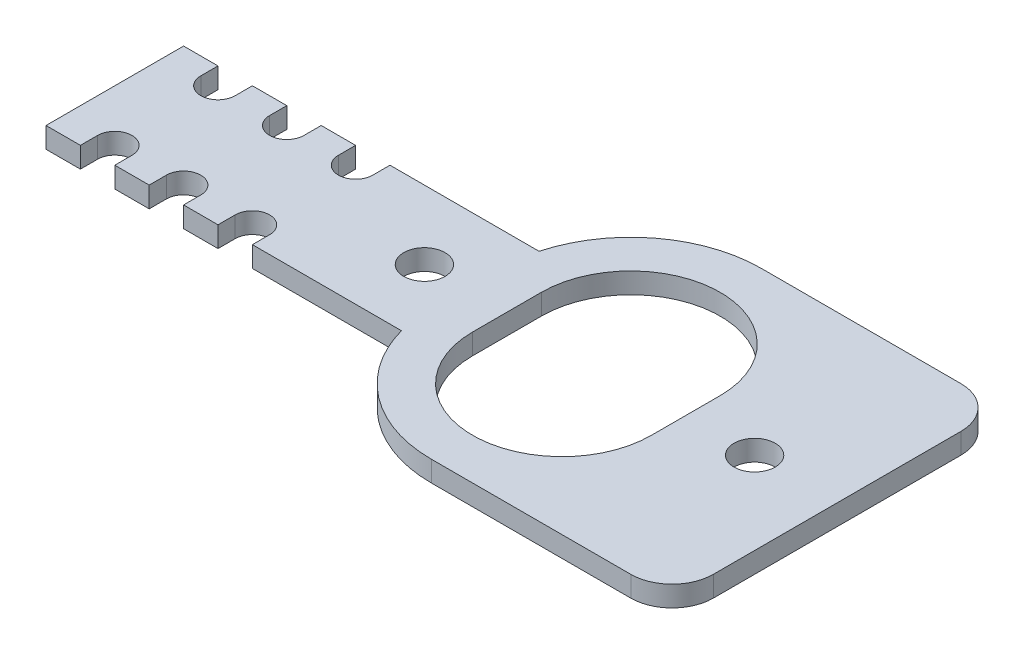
from build123d import *

# Parameters (mm, degrees)
SKETCH1_R      = 3
EXTRUDE1_DEPTH = 3


with BuildPart() as part:
    # Sketch1 → Extrude1 (new body)
    with BuildSketch(Plane(origin=(0, 0, 0), x_dir=(1, 0, 0), z_dir=(0, 1, 0))):
        with BuildLine():
            Line((5, 31.5), (5, 34))
            Line((5, 34), (0, 34))
            Line((0, 34), (0, 14))
            Line((0, 14), (5, 14))
            Line((5, 14), (5, 16.5))
            ThreePointArc((5, 16.5), (7.5, 19), (10, 16.5))
            Line((10, 16.5), (10, 14))
            Line((10, 14), (15, 14))
            Line((15, 14), (15, 16.5))
            ThreePointArc((15, 16.5), (17.5, 19), (20, 16.5))
            Line((20, 16.5), (20, 14))
            Line((20, 14), (25, 14))
            Line((25, 14), (25, 16.5))
            ThreePointArc((25, 16.5), (27.5, 19), (30, 16.5))
            Line((30, 16.5), (30, 14))
            Line((30, 14), (51.66969722, 14))
            ThreePointArc((51.66969722, 14), (58.467437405, 3.900331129), (70, 0))
            Line((70, 0), (99, 0))
            ThreePointArc((99, 0), (103.242640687, 1.757359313), (105, 6))
            Line((105, 6), (105, 42))
            ThreePointArc((105, 42), (103.242640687, 46.242640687), (99, 48))
            Line((99, 48), (70, 48))
            ThreePointArc((70, 48), (58.467437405, 44.099668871), (51.66969722, 34))
            Line((51.66969722, 34), (30, 34))
            Line((30, 34), (30, 31.5))
            ThreePointArc((30, 31.5), (27.5, 29), (25, 31.5))
            Line((25, 31.5), (25, 34))
            Line((25, 34), (20, 34))
            Line((20, 34), (20, 31.5))
            ThreePointArc((20, 31.5), (17.5, 29), (15, 31.5))
            Line((15, 31.5), (15, 34))
            Line((15, 34), (10, 34))
            Line((10, 34), (10, 31.5))
            ThreePointArc((10, 31.5), (7.5, 29), (5, 31.5))
        make_face()
        with Locations(Location((45, 24, 0), (0, 0, 270))):
            Circle(SKETCH1_R, mode=Mode.SUBTRACT)
        with Locations(Location((93, 24, 0), (0, 0, 270))):
            Circle(SKETCH1_R, mode=Mode.SUBTRACT)
        with BuildLine():
            Line((57, 29), (57, 19))
            ThreePointArc((57, 19), (70, 6), (83, 19))
            Line((83, 19), (83, 29))
            ThreePointArc((83, 29), (70, 42), (57, 29))
        make_face(mode=Mode.SUBTRACT)
    extrude(amount=EXTRUDE1_DEPTH)


solid = part.part
